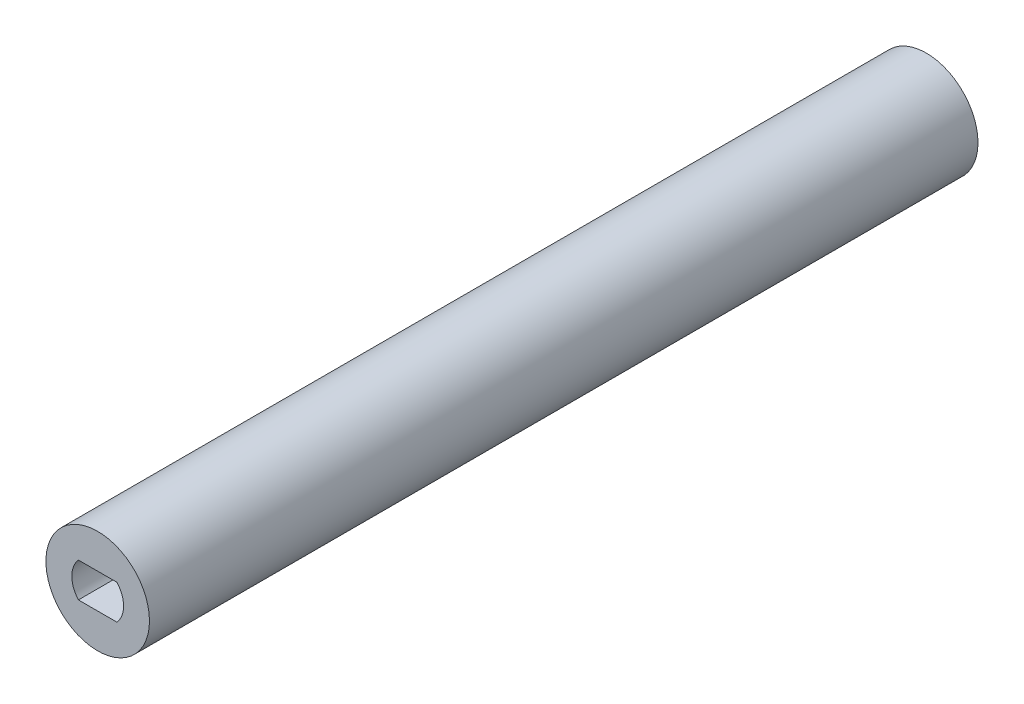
from build123d import *

# Parameters (mm, degrees)
SKETCH1_R           = 6
BOSS_EXTRUDE1_DEPTH = 48
CUT_EXTRUDE1_DEPTH  = 8


with BuildPart() as part:
    # Sketch1 → Boss-Extrude1 (new, symmetric)
    with BuildSketch(Plane.XY):
        Circle(SKETCH1_R)
    extrude(amount=BOSS_EXTRUDE1_DEPTH, both=True)

    # Sketch2 → Cut-Extrude1 (cut)
    with BuildSketch(Plane.XY.offset(48)):
        with BuildLine():
            ThreePointArc((3, 0), (2.802517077, 1.070466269), (2.236067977, 2))
            Line((2.236067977, 2), (-2.236067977, 2))
            ThreePointArc((-2.236067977, 2), (-3, 0), (-2.236067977, -2))
            Line((-2.236067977, -2), (2.236067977, -2))
            ThreePointArc((2.236067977, -2), (2.802517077, -1.070466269), (3, 0))
        make_face()
    extrude(amount=-CUT_EXTRUDE1_DEPTH, mode=Mode.SUBTRACT)


solid = part.part
